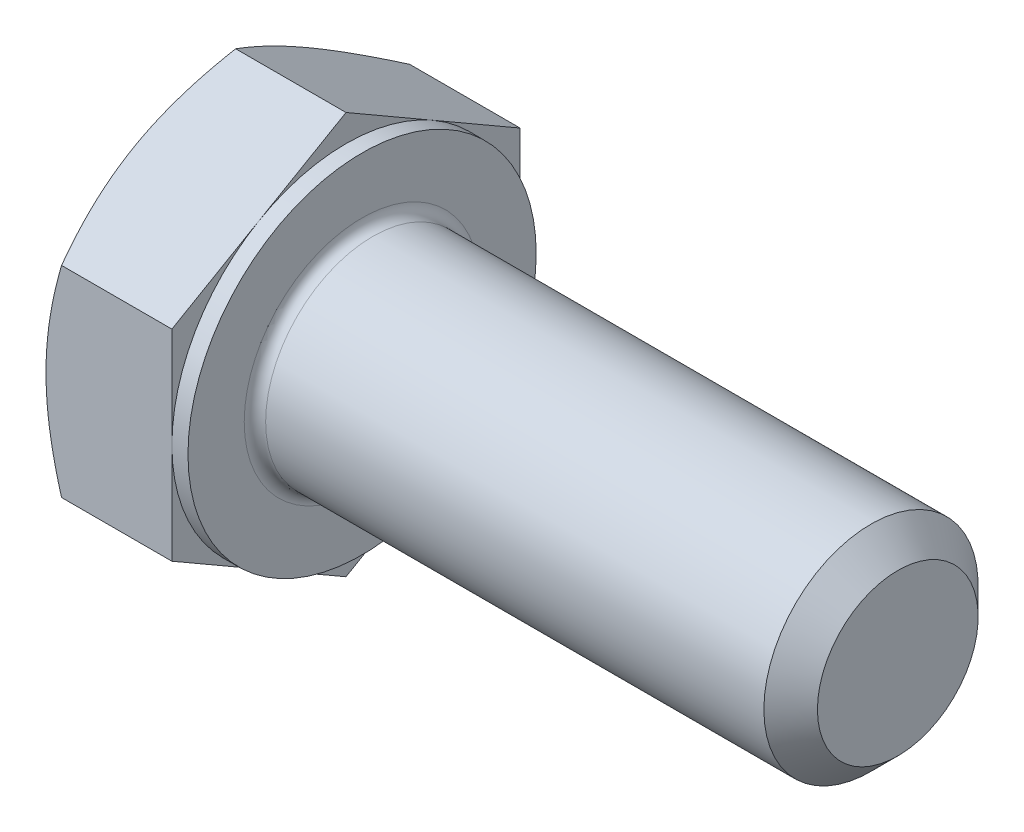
ISO-10303-21;
HEADER;
FILE_DESCRIPTION(('STEP AP214'),'2;1');
FILE_NAME('part.step','',(''),(''),'','','');
FILE_SCHEMA(('AUTOMOTIVE_DESIGN { 1 0 10303 214 1 1 1 1 }'));
ENDSEC;
DATA;
#1=APPLICATION_CONTEXT('core data for automotive mechanical design processes');
#2=APPLICATION_PROTOCOL_DEFINITION('international standard','automotive_design',2000,#1);
#3=PRODUCT_CONTEXT('',#1,'mechanical');
#4=PRODUCT('Part','Part','',(#3));
#5=PRODUCT_RELATED_PRODUCT_CATEGORY('part','',(#4));
#6=PRODUCT_DEFINITION_FORMATION('','',#4);
#7=PRODUCT_DEFINITION_CONTEXT('part definition',#1,'design');
#8=PRODUCT_DEFINITION('design','',#6,#7);
#9=PRODUCT_DEFINITION_SHAPE('','',#8);
#10=(LENGTH_UNIT() NAMED_UNIT(*) SI_UNIT(.MILLI.,.METRE.));
#11=(NAMED_UNIT(*) PLANE_ANGLE_UNIT() SI_UNIT($,.RADIAN.));
#12=(NAMED_UNIT(*) SI_UNIT($,.STERADIAN.) SOLID_ANGLE_UNIT());
#13=UNCERTAINTY_MEASURE_WITH_UNIT(LENGTH_MEASURE(1.E-05),#10,'distance_accuracy_value','');
#14=(GEOMETRIC_REPRESENTATION_CONTEXT(3) GLOBAL_UNCERTAINTY_ASSIGNED_CONTEXT((#13)) GLOBAL_UNIT_ASSIGNED_CONTEXT((#10,
#11,#12)) REPRESENTATION_CONTEXT('',''));
#15=CARTESIAN_POINT('',(0.,0.,0.));
#16=DIRECTION('',(0.,0.,1.));
#17=DIRECTION('',(1.,0.,0.));
#18=AXIS2_PLACEMENT_3D('',#15,#16,#17);
#19=CARTESIAN_POINT('',(5.3,3.75277674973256,-6.5));
#20=DIRECTION('',(0.,-0.866025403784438,0.500000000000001));
#21=DIRECTION('',(0.,-0.500000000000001,-0.866025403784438));
#22=AXIS2_PLACEMENT_3D('',#19,#20,#21);
#23=PLANE('',#22);
#24=DIRECTION('',(0.,0.500000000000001,0.866025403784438));
#25=VECTOR('',#24,1.);
#26=CARTESIAN_POINT('',(4.7,3.75277674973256,-6.5));
#27=LINE('',#26,#25);
#28=CARTESIAN_POINT('',(4.7,3.75277674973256,-6.5));
#29=VERTEX_POINT('',#28);
#30=CARTESIAN_POINT('',(4.7,5.62916512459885,-3.25000000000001));
#31=VERTEX_POINT('',#30);
#32=EDGE_CURVE('E175',#29,#31,#27,.T.);
#33=ORIENTED_EDGE('',*,*,#32,.F.);
#34=DIRECTION('',(-1.,0.,0.));
#35=VECTOR('',#34,1.);
#36=CARTESIAN_POINT('',(5.3,3.75277674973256,-6.5));
#37=LINE('',#36,#35);
#38=CARTESIAN_POINT('',(0.580556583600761,3.75277674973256,-6.5));
#39=VERTEX_POINT('',#38);
#40=EDGE_CURVE('E303',#29,#39,#37,.T.);
#41=ORIENTED_EDGE('',*,*,#40,.T.);
#42=CARTESIAN_POINT('',(0.580623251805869,7.50566896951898,0.000200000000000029));
#43=CARTESIAN_POINT('',(0.533004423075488,7.4231786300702,-0.14267745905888));
#44=CARTESIAN_POINT('',(0.487546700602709,7.34038072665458,-0.286087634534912));
#45=CARTESIAN_POINT('',(0.401548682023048,7.17411251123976,-0.574072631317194));
#46=CARTESIAN_POINT('',(0.361010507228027,7.09064192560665,-0.718647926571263));
#47=CARTESIAN_POINT('',(0.24757100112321,6.83889369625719,-1.15468865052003));
#48=CARTESIAN_POINT('',(0.183047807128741,6.66962231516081,-1.44787528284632));
#49=CARTESIAN_POINT('',(0.107386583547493,6.41631077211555,-1.88662374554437));
#50=CARTESIAN_POINT('',(0.0858328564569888,6.33302748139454,-2.03087463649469));
#51=CARTESIAN_POINT('',(0.04969031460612,6.16608458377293,-2.32002821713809));
#52=CARTESIAN_POINT('',(0.0351008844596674,6.08242501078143,-2.46493084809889));
#53=CARTESIAN_POINT('',(0.0132587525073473,5.91496056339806,-2.75498777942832));
#54=CARTESIAN_POINT('',(0.0059977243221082,5.8311559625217,-2.90014160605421));
#55=CARTESIAN_POINT('',(-0.00103969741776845,5.66347396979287,-3.19057533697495));
#56=CARTESIAN_POINT('',(-0.000816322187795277,5.5795965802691,-3.33585523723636));
#57=CARTESIAN_POINT('',(0.010083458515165,5.34979921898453,-3.73387594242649));
#58=CARTESIAN_POINT('',(0.0283818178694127,5.20395446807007,-3.98648646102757));
#59=CARTESIAN_POINT('',(0.0864063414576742,4.91323365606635,-4.49002967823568));
#60=CARTESIAN_POINT('',(0.126152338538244,4.76835861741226,-4.74096060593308));
#61=CARTESIAN_POINT('',(0.225505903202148,4.47705272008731,-5.24551722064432));
#62=CARTESIAN_POINT('',(0.285534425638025,4.33065861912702,-5.49907924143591));
#63=CARTESIAN_POINT('',(0.421774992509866,4.04005357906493,-6.00242193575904));
#64=CARTESIAN_POINT('',(0.49795503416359,3.89583891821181,-6.25220905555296));
#65=CARTESIAN_POINT('',(0.580623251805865,3.75266127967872,-6.5002));
#66=B_SPLINE_CURVE_WITH_KNOTS('',3,(#42,#43,#44,#45,#46,#47,#48,#49,#50,#51,#52,#53,#54,#55,#56,
#57,#58,#59,#60,#61,#62,#63,#64,#65),.UNSPECIFIED.,.F.,.F.,(4,2,2,2,2,2,2,2,2,2,2,4),(0.,
0.515105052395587,1.03043143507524,2.06322554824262,2.56697389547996,3.07067772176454,
3.57380860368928,4.0769239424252,4.9527935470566,5.82947446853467,6.72559912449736,
7.61996451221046),.UNSPECIFIED.);
#67=CARTESIAN_POINT('',(0.,5.62916512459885,-3.25000000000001));
#68=VERTEX_POINT('',#67);
#69=EDGE_CURVE('E230',#68,#39,#66,.T.);
#70=ORIENTED_EDGE('',*,*,#69,.F.);
#71=CARTESIAN_POINT('',(0.580556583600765,7.50555349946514,0.));
#72=VERTEX_POINT('',#71);
#73=EDGE_CURVE('E66',#72,#68,#66,.T.);
#74=ORIENTED_EDGE('',*,*,#73,.F.);
#75=DIRECTION('',(-1.,0.,0.));
#76=VECTOR('',#75,1.);
#77=CARTESIAN_POINT('',(5.3,7.50555349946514,0.));
#78=LINE('',#77,#76);
#79=CARTESIAN_POINT('',(4.7,7.50555349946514,0.));
#80=VERTEX_POINT('',#79);
#81=EDGE_CURVE('E295',#80,#72,#78,.T.);
#82=ORIENTED_EDGE('',*,*,#81,.F.);
#83=EDGE_CURVE('E173',#31,#80,#27,.T.);
#84=ORIENTED_EDGE('',*,*,#83,.F.);
#85=EDGE_LOOP('',(#33,#41,#70,#74,#82,#84));
#86=FACE_BOUND('',#85,.T.);
#87=ADVANCED_FACE('F43',(#86),#23,.F.);
#88=CARTESIAN_POINT('',(5.3,7.50555349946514,0.));
#89=DIRECTION('',(0.,-0.866025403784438,-0.500000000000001));
#90=DIRECTION('',(0.,0.500000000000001,-0.866025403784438));
#91=AXIS2_PLACEMENT_3D('',#88,#89,#90);
#92=PLANE('',#91);
#93=DIRECTION('',(0.,-0.500000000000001,0.866025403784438));
#94=VECTOR('',#93,1.);
#95=CARTESIAN_POINT('',(4.7,7.50555349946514,0.));
#96=LINE('',#95,#94);
#97=CARTESIAN_POINT('',(4.7,5.62916512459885,3.25000000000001));
#98=VERTEX_POINT('',#97);
#99=EDGE_CURVE('E172',#80,#98,#96,.T.);
#100=ORIENTED_EDGE('',*,*,#99,.F.);
#101=ORIENTED_EDGE('',*,*,#81,.T.);
#102=CARTESIAN_POINT('',(0.580623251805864,3.75266127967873,6.50019999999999));
#103=CARTESIAN_POINT('',(0.533004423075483,3.83515161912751,6.35732254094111));
#104=CARTESIAN_POINT('',(0.487546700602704,3.91794952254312,6.21391236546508));
#105=CARTESIAN_POINT('',(0.401548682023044,4.08421773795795,5.9259273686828));
#106=CARTESIAN_POINT('',(0.361010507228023,4.16768832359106,5.78135207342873));
#107=CARTESIAN_POINT('',(0.247571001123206,4.41943655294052,5.34531134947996));
#108=CARTESIAN_POINT('',(0.183047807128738,4.5887079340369,5.05212471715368));
#109=CARTESIAN_POINT('',(0.107386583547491,4.84201947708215,4.61337625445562));
#110=CARTESIAN_POINT('',(0.0858328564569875,4.92530276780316,4.4691253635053));
#111=CARTESIAN_POINT('',(0.0496903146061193,5.09224566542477,4.17997178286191));
#112=CARTESIAN_POINT('',(0.035100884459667,5.17590523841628,4.03506915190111));
#113=CARTESIAN_POINT('',(0.0132587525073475,5.34336968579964,3.74501222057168));
#114=CARTESIAN_POINT('',(0.00599772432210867,5.427174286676,3.59985839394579));
#115=CARTESIAN_POINT('',(-0.00103969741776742,5.59485627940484,3.30942466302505));
#116=CARTESIAN_POINT('',(-0.000816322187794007,5.67873366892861,3.16414476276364));
#117=CARTESIAN_POINT('',(0.0100834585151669,5.90853103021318,2.7661240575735));
#118=CARTESIAN_POINT('',(0.0283818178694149,6.05437578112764,2.51351353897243));
#119=CARTESIAN_POINT('',(0.0864063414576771,6.34509659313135,2.00997032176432));
#120=CARTESIAN_POINT('',(0.126152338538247,6.48997163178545,1.75903939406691));
#121=CARTESIAN_POINT('',(0.225505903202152,6.78127752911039,1.25448277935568));
#122=CARTESIAN_POINT('',(0.285534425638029,6.92767163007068,1.00092075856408));
#123=CARTESIAN_POINT('',(0.421774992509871,7.21827667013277,0.497578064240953));
#124=CARTESIAN_POINT('',(0.497955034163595,7.36249133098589,0.247790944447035));
#125=CARTESIAN_POINT('',(0.58062325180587,7.50566896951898,-0.000200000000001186));
#126=B_SPLINE_CURVE_WITH_KNOTS('',3,(#102,#103,#104,#105,#106,#107,#108,#109,#110,#111,#112,
#113,#114,#115,#116,#117,#118,#119,#120,#121,#122,#123,#124,#125),.UNSPECIFIED.,.F.,.F.,(4,2,2,
2,2,2,2,2,2,2,2,4),(0.,0.515105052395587,1.03043143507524,2.06322554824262,2.56697389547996,
3.07067772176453,3.57380860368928,4.0769239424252,4.9527935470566,5.82947446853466,
6.72559912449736,7.61996451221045),.UNSPECIFIED.);
#127=CARTESIAN_POINT('',(0.,5.62916512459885,3.25));
#128=VERTEX_POINT('',#127);
#129=EDGE_CURVE('E227',#128,#72,#126,.T.);
#130=ORIENTED_EDGE('',*,*,#129,.F.);
#131=CARTESIAN_POINT('',(0.58055658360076,3.75277674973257,6.49999999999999));
#132=VERTEX_POINT('',#131);
#133=EDGE_CURVE('E241',#132,#128,#126,.T.);
#134=ORIENTED_EDGE('',*,*,#133,.F.);
#135=DIRECTION('',(-1.,0.,0.));
#136=VECTOR('',#135,1.);
#137=CARTESIAN_POINT('',(5.3,3.75277674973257,6.49999999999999));
#138=LINE('',#137,#136);
#139=CARTESIAN_POINT('',(4.7,3.75277674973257,6.49999999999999));
#140=VERTEX_POINT('',#139);
#141=EDGE_CURVE('E297',#140,#132,#138,.T.);
#142=ORIENTED_EDGE('',*,*,#141,.F.);
#143=EDGE_CURVE('E140',#98,#140,#96,.T.);
#144=ORIENTED_EDGE('',*,*,#143,.F.);
#145=EDGE_LOOP('',(#100,#101,#130,#134,#142,#144));
#146=FACE_BOUND('',#145,.T.);
#147=ADVANCED_FACE('F248',(#146),#92,.F.);
#148=CARTESIAN_POINT('',(5.3,3.75277674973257,6.49999999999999));
#149=DIRECTION('',(0.,0.,-1.));
#150=DIRECTION('',(0.,1.,0.));
#151=AXIS2_PLACEMENT_3D('',#148,#149,#150);
#152=PLANE('',#151);
#153=DIRECTION('',(0.,-1.,0.));
#154=VECTOR('',#153,1.);
#155=CARTESIAN_POINT('',(4.7,3.75277674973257,6.49999999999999));
#156=LINE('',#155,#154);
#157=CARTESIAN_POINT('',(4.7,0.,6.5));
#158=VERTEX_POINT('',#157);
#159=EDGE_CURVE('E134',#140,#158,#156,.T.);
#160=ORIENTED_EDGE('',*,*,#159,.F.);
#161=ORIENTED_EDGE('',*,*,#141,.T.);
#162=CARTESIAN_POINT('',(3.18835311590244,-10.1137456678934,6.5));
#163=CARTESIAN_POINT('',(3.05034774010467,-9.82952666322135,6.5));
#164=CARTESIAN_POINT('',(2.91365616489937,-9.54465869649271,6.5));
#165=CARTESIAN_POINT('',(2.6436389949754,-8.97327978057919,6.5));
#166=CARTESIAN_POINT('',(2.51031392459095,-8.6867685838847,6.5));
#167=CARTESIAN_POINT('',(2.24710473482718,-8.11029837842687,6.5));
#168=CARTESIAN_POINT('',(2.11724300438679,-7.82032911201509,6.5));
#169=CARTESIAN_POINT('',(1.86279082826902,-7.23809541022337,6.5));
#170=CARTESIAN_POINT('',(1.73820013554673,-6.94583108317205,6.5));
#171=CARTESIAN_POINT('',(1.4917668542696,-6.34906440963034,6.5));
#172=CARTESIAN_POINT('',(1.37014257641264,-6.0444714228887,6.5));
#173=CARTESIAN_POINT('',(1.13601865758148,-5.43173420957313,6.5));
#174=CARTESIAN_POINT('',(1.02352003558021,-5.12358959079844,6.5));
#175=CARTESIAN_POINT('',(0.81057536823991,-4.50382569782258,6.5));
#176=CARTESIAN_POINT('',(0.710105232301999,-4.19221478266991,6.5));
#177=CARTESIAN_POINT('',(0.524420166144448,-3.5645201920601,6.5));
#178=CARTESIAN_POINT('',(0.439200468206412,-3.24843794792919,6.5));
#179=CARTESIAN_POINT('',(0.288524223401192,-2.61335465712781,6.5));
#180=CARTESIAN_POINT('',(0.222961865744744,-2.29437912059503,6.5));
#181=CARTESIAN_POINT('',(0.115312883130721,-1.65238219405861,6.5));
#182=CARTESIAN_POINT('',(0.07322390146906,-1.32936121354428,6.5));
#183=CARTESIAN_POINT('',(0.0304887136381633,-0.845231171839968,6.5));
#184=CARTESIAN_POINT('',(0.0196493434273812,-0.684982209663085,6.5));
#185=CARTESIAN_POINT('',(0.00475298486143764,-0.364162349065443,6.5));
#186=CARTESIAN_POINT('',(0.000695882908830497,-0.203591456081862,6.5));
#187=CARTESIAN_POINT('',(-0.000531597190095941,0.117577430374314,6.5));
#188=CARTESIAN_POINT('',(0.002298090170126,0.278175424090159,6.5));
#189=CARTESIAN_POINT('',(0.0147726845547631,0.599108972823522,6.5));
#190=CARTESIAN_POINT('',(0.0244179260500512,0.759444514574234,6.5));
#191=CARTESIAN_POINT('',(0.0554961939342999,1.14369946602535,6.5));
#192=CARTESIAN_POINT('',(0.080103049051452,1.36736763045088,6.49999999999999));
#193=CARTESIAN_POINT('',(0.141246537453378,1.81305591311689,6.49999999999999));
#194=CARTESIAN_POINT('',(0.177784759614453,2.0350758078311,6.49999999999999));
#195=CARTESIAN_POINT('',(0.303360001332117,2.69839633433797,6.49999999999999));
#196=CARTESIAN_POINT('',(0.408335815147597,3.13672010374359,6.49999999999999));
#197=CARTESIAN_POINT('',(0.590564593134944,3.7923211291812,6.49999999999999));
#198=CARTESIAN_POINT('',(0.656313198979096,4.01299150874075,6.49999999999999));
#199=CARTESIAN_POINT('',(0.794681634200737,4.45218859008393,6.49999999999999));
#200=CARTESIAN_POINT('',(0.867301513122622,4.67071527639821,6.49999999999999));
#201=CARTESIAN_POINT('',(1.01824353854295,5.10569490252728,6.49999999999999));
#202=CARTESIAN_POINT('',(1.09656388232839,5.32214847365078,6.49999999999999));
#203=CARTESIAN_POINT('',(1.25798086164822,5.75325725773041,6.49999999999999));
#204=CARTESIAN_POINT('',(1.34107741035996,5.96791250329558,6.49999999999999));
#205=CARTESIAN_POINT('',(1.56029019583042,6.51888445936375,6.49999999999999));
#206=CARTESIAN_POINT('',(1.69936356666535,6.85402316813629,6.49999999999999));
#207=CARTESIAN_POINT('',(1.98501958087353,7.52109583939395,6.49999999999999));
#208=CARTESIAN_POINT('',(2.13160288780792,7.85302951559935,6.49999999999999));
#209=CARTESIAN_POINT('',(2.43059748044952,8.51437865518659,6.49999999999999));
#210=CARTESIAN_POINT('',(2.5830105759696,8.84379329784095,6.49999999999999));
#211=CARTESIAN_POINT('',(2.89234869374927,9.50047798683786,6.49999999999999));
#212=CARTESIAN_POINT('',(3.04927357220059,9.82774810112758,6.49999999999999));
#213=CARTESIAN_POINT('',(3.36692013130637,10.4809971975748,6.49999999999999));
#214=CARTESIAN_POINT('',(3.52764676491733,10.8069737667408,6.49999999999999));
#215=CARTESIAN_POINT('',(3.851985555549,11.4574882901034,6.49999999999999));
#216=CARTESIAN_POINT('',(4.01559773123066,11.7820262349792,6.49999999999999));
#217=CARTESIAN_POINT('',(4.50986185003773,12.7537468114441,6.49999999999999));
#218=CARTESIAN_POINT('',(4.84399997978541,13.3991555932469,6.49999999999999));
#219=CARTESIAN_POINT('',(5.48575990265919,14.6239779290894,6.49999999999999));
#220=CARTESIAN_POINT('',(5.79279643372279,15.2036995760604,6.49999999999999));
#221=CARTESIAN_POINT('',(6.4106918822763,16.3611382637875,6.49999999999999));
#222=CARTESIAN_POINT('',(6.72155099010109,16.938855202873,6.49999999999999));
#223=CARTESIAN_POINT('',(7.34519775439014,18.0910273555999,6.49999999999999));
#224=CARTESIAN_POINT('',(7.65797694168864,18.665487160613,6.49999999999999));
#225=CARTESIAN_POINT('',(8.28574397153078,19.8131486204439,6.49999999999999));
#226=CARTESIAN_POINT('',(8.60073166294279,20.3863503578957,6.49999999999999));
#227=CARTESIAN_POINT('',(8.91652967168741,20.9591024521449,6.49999999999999));
#228=B_SPLINE_CURVE_WITH_KNOTS('',3,(#162,#163,#164,#165,#166,#167,#168,#169,#170,#171,#172,
#173,#174,#175,#176,#177,#178,#179,#180,#181,#182,#183,#184,#185,#186,#187,#188,#189,#190,#191,
#192,#193,#194,#195,#196,#197,#198,#199,#200,#201,#202,#203,#204,#205,#206,#207,#208,#209,#210,
#211,#212,#213,#214,#215,#216,#217,#218,#219,#220,#221,#222,#223,#224,#225,#226,#227),
.UNSPECIFIED.,.F.,.F.,(4,2,2,2,2,2,2,2,2,2,2,2,2,2,2,2,2,2,2,2,2,2,2,2,2,2,2,2,2,2,2,2,4),(0.,
0.947868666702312,1.89588406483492,2.84900320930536,3.80207763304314,4.7858977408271,
5.76982755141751,6.75175256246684,7.73337005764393,8.7096047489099,9.68574140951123,
10.1674651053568,10.6491807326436,11.1309009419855,11.6126447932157,12.287317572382,
12.9620802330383,14.3123184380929,15.0030310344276,15.6937486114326,16.384248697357,
17.0747362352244,18.1631508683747,19.2516618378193,20.3405135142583,21.4293305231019,
22.5196540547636,23.6099846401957,25.7902468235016,27.7582608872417,29.7263733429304,
31.6886408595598,33.6507753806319),.UNSPECIFIED.);
#229=CARTESIAN_POINT('',(0.,0.,6.5));
#230=VERTEX_POINT('',#229);
#231=EDGE_CURVE('E242',#230,#132,#228,.T.);
#232=ORIENTED_EDGE('',*,*,#231,.F.);
#233=CARTESIAN_POINT('',(0.580556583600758,-3.75277674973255,6.5));
#234=VERTEX_POINT('',#233);
#235=EDGE_CURVE('E304',#234,#230,#228,.T.);
#236=ORIENTED_EDGE('',*,*,#235,.F.);
#237=DIRECTION('',(-1.,0.,0.));
#238=VECTOR('',#237,1.);
#239=CARTESIAN_POINT('',(5.3,-3.75277674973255,6.5));
#240=LINE('',#239,#238);
#241=CARTESIAN_POINT('',(4.7,-3.75277674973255,6.5));
#242=VERTEX_POINT('',#241);
#243=EDGE_CURVE('E166',#242,#234,#240,.T.);
#244=ORIENTED_EDGE('',*,*,#243,.F.);
#245=EDGE_CURVE('E144',#158,#242,#156,.T.);
#246=ORIENTED_EDGE('',*,*,#245,.F.);
#247=EDGE_LOOP('',(#160,#161,#232,#236,#244,#246));
#248=FACE_BOUND('',#247,.T.);
#249=ADVANCED_FACE('F164',(#248),#152,.F.);
#250=CARTESIAN_POINT('',(5.3,-7.50555349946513,0.));
#251=DIRECTION('',(0.,0.866025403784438,-0.500000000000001));
#252=DIRECTION('',(0.,0.500000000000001,0.866025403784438));
#253=AXIS2_PLACEMENT_3D('',#250,#251,#252);
#254=PLANE('',#253);
#255=DIRECTION('',(0.,-0.500000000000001,-0.866025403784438));
#256=VECTOR('',#255,1.);
#257=CARTESIAN_POINT('',(4.7,-7.50555349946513,0.));
#258=LINE('',#257,#256);
#259=CARTESIAN_POINT('',(4.7,-5.62916512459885,3.25000000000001));
#260=VERTEX_POINT('',#259);
#261=EDGE_CURVE('E151',#242,#260,#258,.T.);
#262=ORIENTED_EDGE('',*,*,#261,.F.);
#263=ORIENTED_EDGE('',*,*,#243,.T.);
#264=CARTESIAN_POINT('',(0.580623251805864,-7.50566896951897,-0.000199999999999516));
#265=CARTESIAN_POINT('',(0.533004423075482,-7.42317863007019,0.142677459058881));
#266=CARTESIAN_POINT('',(0.487546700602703,-7.34038072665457,0.286087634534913));
#267=CARTESIAN_POINT('',(0.401548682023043,-7.17411251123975,0.574072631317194));
#268=CARTESIAN_POINT('',(0.361010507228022,-7.09064192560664,0.718647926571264));
#269=CARTESIAN_POINT('',(0.247571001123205,-6.83889369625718,1.15468865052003));
#270=CARTESIAN_POINT('',(0.183047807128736,-6.6696223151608,1.44787528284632));
#271=CARTESIAN_POINT('',(0.107386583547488,-6.41631077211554,1.88662374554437));
#272=CARTESIAN_POINT('',(0.0858328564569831,-6.33302748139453,2.03087463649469));
#273=CARTESIAN_POINT('',(0.0496903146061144,-6.16608458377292,2.32002821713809));
#274=CARTESIAN_POINT('',(0.0351008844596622,-6.08242501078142,2.46493084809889));
#275=CARTESIAN_POINT('',(0.0132587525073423,-5.91496056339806,2.75498777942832));
#276=CARTESIAN_POINT('',(0.0059977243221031,-5.83115596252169,2.90014160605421));
#277=CARTESIAN_POINT('',(-0.0010396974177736,-5.66347396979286,3.19057533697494));
#278=CARTESIAN_POINT('',(-0.000816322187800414,-5.57959658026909,3.33585523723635));
#279=CARTESIAN_POINT('',(0.0100834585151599,-5.34979921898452,3.73387594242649));
#280=CARTESIAN_POINT('',(0.0283818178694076,-5.20395446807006,3.98648646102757));
#281=CARTESIAN_POINT('',(0.0864063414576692,-4.91323365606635,4.49002967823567));
#282=CARTESIAN_POINT('',(0.126152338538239,-4.76835861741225,4.74096060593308));
#283=CARTESIAN_POINT('',(0.225505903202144,-4.4770527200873,5.24551722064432));
#284=CARTESIAN_POINT('',(0.285534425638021,-4.33065861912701,5.49907924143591));
#285=CARTESIAN_POINT('',(0.421774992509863,-4.04005357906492,6.00242193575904));
#286=CARTESIAN_POINT('',(0.497955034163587,-3.8958389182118,6.25220905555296));
#287=CARTESIAN_POINT('',(0.580623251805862,-3.75266127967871,6.5002));
#288=B_SPLINE_CURVE_WITH_KNOTS('',3,(#264,#265,#266,#267,#268,#269,#270,#271,#272,#273,#274,
#275,#276,#277,#278,#279,#280,#281,#282,#283,#284,#285,#286,#287),.UNSPECIFIED.,.F.,.F.,(4,2,2,
2,2,2,2,2,2,2,2,4),(0.,0.515105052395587,1.03043143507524,2.06322554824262,2.56697389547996,
3.07067772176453,3.57380860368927,4.0769239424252,4.9527935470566,5.82947446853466,
6.72559912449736,7.61996451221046),.UNSPECIFIED.);
#289=CARTESIAN_POINT('',(0.,-5.62916512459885,3.25000000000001));
#290=VERTEX_POINT('',#289);
#291=EDGE_CURVE('E229',#290,#234,#288,.T.);
#292=ORIENTED_EDGE('',*,*,#291,.F.);
#293=CARTESIAN_POINT('',(0.580556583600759,-7.50555349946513,0.));
#294=VERTEX_POINT('',#293);
#295=EDGE_CURVE('E221',#294,#290,#288,.T.);
#296=ORIENTED_EDGE('',*,*,#295,.F.);
#297=DIRECTION('',(-1.,0.,0.));
#298=VECTOR('',#297,1.);
#299=CARTESIAN_POINT('',(5.3,-7.50555349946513,0.));
#300=LINE('',#299,#298);
#301=CARTESIAN_POINT('',(4.7,-7.50555349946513,0.));
#302=VERTEX_POINT('',#301);
#303=EDGE_CURVE('E300',#302,#294,#300,.T.);
#304=ORIENTED_EDGE('',*,*,#303,.F.);
#305=EDGE_CURVE('E167',#260,#302,#258,.T.);
#306=ORIENTED_EDGE('',*,*,#305,.F.);
#307=EDGE_LOOP('',(#262,#263,#292,#296,#304,#306));
#308=FACE_BOUND('',#307,.T.);
#309=ADVANCED_FACE('F212',(#308),#254,.F.);
#310=CARTESIAN_POINT('',(5.3,-3.75277674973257,-6.5));
#311=DIRECTION('',(0.,0.866025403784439,0.499999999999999));
#312=DIRECTION('',(0.,-0.499999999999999,0.866025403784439));
#313=AXIS2_PLACEMENT_3D('',#310,#311,#312);
#314=PLANE('',#313);
#315=DIRECTION('',(0.,0.499999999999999,-0.866025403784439));
#316=VECTOR('',#315,1.);
#317=CARTESIAN_POINT('',(4.7,-3.75277674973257,-6.5));
#318=LINE('',#317,#316);
#319=CARTESIAN_POINT('',(4.7,-5.62916512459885,-3.25));
#320=VERTEX_POINT('',#319);
#321=EDGE_CURVE('E350',#302,#320,#318,.T.);
#322=ORIENTED_EDGE('',*,*,#321,.F.);
#323=ORIENTED_EDGE('',*,*,#303,.T.);
#324=CARTESIAN_POINT('',(0.580623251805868,-3.75266127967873,-6.5002));
#325=CARTESIAN_POINT('',(0.533004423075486,-3.8351516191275,-6.35732254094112));
#326=CARTESIAN_POINT('',(0.487546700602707,-3.91794952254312,-6.21391236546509));
#327=CARTESIAN_POINT('',(0.401548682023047,-4.08421773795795,-5.92592736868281));
#328=CARTESIAN_POINT('',(0.361010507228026,-4.16768832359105,-5.78135207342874));
#329=CARTESIAN_POINT('',(0.247571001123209,-4.41943655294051,-5.34531134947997));
#330=CARTESIAN_POINT('',(0.183047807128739,-4.5887079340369,-5.05212471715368));
#331=CARTESIAN_POINT('',(0.107386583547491,-4.84201947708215,-4.61337625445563));
#332=CARTESIAN_POINT('',(0.0858328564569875,-4.92530276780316,-4.46912536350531));
#333=CARTESIAN_POINT('',(0.0496903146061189,-5.09224566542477,-4.17997178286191));
#334=CARTESIAN_POINT('',(0.0351008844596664,-5.17590523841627,-4.03506915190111));
#335=CARTESIAN_POINT('',(0.0132587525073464,-5.34336968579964,-3.74501222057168));
#336=CARTESIAN_POINT('',(0.00599772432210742,-5.427174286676,-3.59985839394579));
#337=CARTESIAN_POINT('',(-0.00103969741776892,-5.59485627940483,-3.30942466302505));
#338=CARTESIAN_POINT('',(-0.000816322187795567,-5.6787336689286,-3.16414476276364));
#339=CARTESIAN_POINT('',(0.0100834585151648,-5.90853103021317,-2.7661240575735));
#340=CARTESIAN_POINT('',(0.0283818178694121,-6.05437578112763,-2.51351353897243));
#341=CARTESIAN_POINT('',(0.0864063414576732,-6.34509659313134,-2.00997032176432));
#342=CARTESIAN_POINT('',(0.126152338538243,-6.48997163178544,-1.75903939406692));
#343=CARTESIAN_POINT('',(0.225505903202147,-6.78127752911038,-1.25448277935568));
#344=CARTESIAN_POINT('',(0.285534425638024,-6.92767163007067,-1.00092075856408));
#345=CARTESIAN_POINT('',(0.421774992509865,-7.21827667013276,-0.497578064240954));
#346=CARTESIAN_POINT('',(0.49795503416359,-7.36249133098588,-0.247790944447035));
#347=CARTESIAN_POINT('',(0.580623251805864,-7.50566896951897,0.00020000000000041));
#348=B_SPLINE_CURVE_WITH_KNOTS('',3,(#324,#325,#326,#327,#328,#329,#330,#331,#332,#333,#334,
#335,#336,#337,#338,#339,#340,#341,#342,#343,#344,#345,#346,#347),.UNSPECIFIED.,.F.,.F.,(4,2,2,
2,2,2,2,2,2,2,2,4),(0.,0.515105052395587,1.03043143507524,2.06322554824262,2.56697389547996,
3.07067772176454,3.57380860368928,4.0769239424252,4.9527935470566,5.82947446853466,
6.72559912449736,7.61996451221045),.UNSPECIFIED.);
#349=CARTESIAN_POINT('',(0.,-5.62916512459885,-3.24999999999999));
#350=VERTEX_POINT('',#349);
#351=EDGE_CURVE('E228',#350,#294,#348,.T.);
#352=ORIENTED_EDGE('',*,*,#351,.F.);
#353=CARTESIAN_POINT('',(0.580556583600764,-3.75277674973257,-6.5));
#354=VERTEX_POINT('',#353);
#355=EDGE_CURVE('E189',#354,#350,#348,.T.);
#356=ORIENTED_EDGE('',*,*,#355,.F.);
#357=DIRECTION('',(-1.,0.,0.));
#358=VECTOR('',#357,1.);
#359=CARTESIAN_POINT('',(5.3,-3.75277674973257,-6.5));
#360=LINE('',#359,#358);
#361=CARTESIAN_POINT('',(4.7,-3.75277674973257,-6.5));
#362=VERTEX_POINT('',#361);
#363=EDGE_CURVE('E302',#362,#354,#360,.T.);
#364=ORIENTED_EDGE('',*,*,#363,.F.);
#365=EDGE_CURVE('E162',#320,#362,#318,.T.);
#366=ORIENTED_EDGE('',*,*,#365,.F.);
#367=EDGE_LOOP('',(#322,#323,#352,#356,#364,#366));
#368=FACE_BOUND('',#367,.T.);
#369=ADVANCED_FACE('F205',(#368),#314,.F.);
#370=CARTESIAN_POINT('',(5.3,3.75277674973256,-6.5));
#371=DIRECTION('',(0.,0.,1.));
#372=DIRECTION('',(0.,-1.,0.));
#373=AXIS2_PLACEMENT_3D('',#370,#371,#372);
#374=PLANE('',#373);
#375=DIRECTION('',(0.,1.,0.));
#376=VECTOR('',#375,1.);
#377=CARTESIAN_POINT('',(4.7,3.75277674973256,-6.5));
#378=LINE('',#377,#376);
#379=CARTESIAN_POINT('',(4.7,0.,-6.5));
#380=VERTEX_POINT('',#379);
#381=EDGE_CURVE('E274',#362,#380,#378,.T.);
#382=ORIENTED_EDGE('',*,*,#381,.F.);
#383=ORIENTED_EDGE('',*,*,#363,.T.);
#384=CARTESIAN_POINT('',(3.18835311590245,-10.1137456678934,-6.5));
#385=CARTESIAN_POINT('',(3.05034774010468,-9.82952666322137,-6.5));
#386=CARTESIAN_POINT('',(2.91365616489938,-9.54465869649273,-6.5));
#387=CARTESIAN_POINT('',(2.64363899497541,-8.97327978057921,-6.5));
#388=CARTESIAN_POINT('',(2.51031392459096,-8.68676858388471,-6.5));
#389=CARTESIAN_POINT('',(2.24710473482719,-8.11029837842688,-6.5));
#390=CARTESIAN_POINT('',(2.1172430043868,-7.82032911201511,-6.5));
#391=CARTESIAN_POINT('',(1.86279082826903,-7.23809541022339,-6.5));
#392=CARTESIAN_POINT('',(1.73820013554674,-6.94583108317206,-6.5));
#393=CARTESIAN_POINT('',(1.49176685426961,-6.34906440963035,-6.5));
#394=CARTESIAN_POINT('',(1.37014257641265,-6.04447142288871,-6.5));
#395=CARTESIAN_POINT('',(1.13601865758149,-5.43173420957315,-6.5));
#396=CARTESIAN_POINT('',(1.02352003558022,-5.12358959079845,-6.5));
#397=CARTESIAN_POINT('',(0.810575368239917,-4.50382569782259,-6.5));
#398=CARTESIAN_POINT('',(0.710105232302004,-4.19221478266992,-6.5));
#399=CARTESIAN_POINT('',(0.524420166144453,-3.56452019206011,-6.5));
#400=CARTESIAN_POINT('',(0.439200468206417,-3.2484379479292,-6.5));
#401=CARTESIAN_POINT('',(0.288524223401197,-2.61335465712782,-6.5));
#402=CARTESIAN_POINT('',(0.222961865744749,-2.29437912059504,-6.5));
#403=CARTESIAN_POINT('',(0.115312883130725,-1.65238219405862,-6.5));
#404=CARTESIAN_POINT('',(0.0732239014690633,-1.32936121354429,-6.5));
#405=CARTESIAN_POINT('',(0.0304887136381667,-0.845231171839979,-6.5));
#406=CARTESIAN_POINT('',(0.0196493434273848,-0.684982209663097,-6.5));
#407=CARTESIAN_POINT('',(0.00475298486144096,-0.364162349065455,-6.5));
#408=CARTESIAN_POINT('',(0.000695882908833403,-0.203591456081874,-6.5));
#409=CARTESIAN_POINT('',(-0.000531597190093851,0.117577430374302,-6.5));
#410=CARTESIAN_POINT('',(0.00229809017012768,0.278175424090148,-6.5));
#411=CARTESIAN_POINT('',(0.0147726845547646,0.599108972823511,-6.5));
#412=CARTESIAN_POINT('',(0.0244179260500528,0.759444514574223,-6.5));
#413=CARTESIAN_POINT('',(0.0554961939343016,1.14369946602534,-6.5));
#414=CARTESIAN_POINT('',(0.0801030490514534,1.36736763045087,-6.5));
#415=CARTESIAN_POINT('',(0.141246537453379,1.81305591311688,-6.5));
#416=CARTESIAN_POINT('',(0.177784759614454,2.03507580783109,-6.5));
#417=CARTESIAN_POINT('',(0.303360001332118,2.69839633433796,-6.5));
#418=CARTESIAN_POINT('',(0.408335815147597,3.13672010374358,-6.5));
#419=CARTESIAN_POINT('',(0.590564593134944,3.79232112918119,-6.5));
#420=CARTESIAN_POINT('',(0.656313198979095,4.01299150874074,-6.5));
#421=CARTESIAN_POINT('',(0.794681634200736,4.45218859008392,-6.5));
#422=CARTESIAN_POINT('',(0.867301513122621,4.6707152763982,-6.5));
#423=CARTESIAN_POINT('',(1.01824353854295,5.10569490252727,-6.5));
#424=CARTESIAN_POINT('',(1.09656388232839,5.32214847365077,-6.5));
#425=CARTESIAN_POINT('',(1.25798086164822,5.7532572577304,-6.5));
#426=CARTESIAN_POINT('',(1.34107741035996,5.96791250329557,-6.5));
#427=CARTESIAN_POINT('',(1.56029019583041,6.51888445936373,-6.5));
#428=CARTESIAN_POINT('',(1.69936356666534,6.85402316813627,-6.5));
#429=CARTESIAN_POINT('',(1.98501958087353,7.52109583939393,-6.5));
#430=CARTESIAN_POINT('',(2.13160288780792,7.85302951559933,-6.5));
#431=CARTESIAN_POINT('',(2.43059748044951,8.51437865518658,-6.5));
#432=CARTESIAN_POINT('',(2.58301057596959,8.84379329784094,-6.5));
#433=CARTESIAN_POINT('',(2.89234869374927,9.50047798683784,-6.5));
#434=CARTESIAN_POINT('',(3.04927357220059,9.82774810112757,-6.5));
#435=CARTESIAN_POINT('',(3.36692013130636,10.4809971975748,-6.5));
#436=CARTESIAN_POINT('',(3.52764676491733,10.8069737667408,-6.5));
#437=CARTESIAN_POINT('',(3.85198555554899,11.4574882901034,-6.5));
#438=CARTESIAN_POINT('',(4.01559773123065,11.7820262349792,-6.5));
#439=CARTESIAN_POINT('',(4.50986185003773,12.753746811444,-6.5));
#440=CARTESIAN_POINT('',(4.8439999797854,13.3991555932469,-6.5));
#441=CARTESIAN_POINT('',(5.48575990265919,14.6239779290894,-6.5));
#442=CARTESIAN_POINT('',(5.79279643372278,15.2036995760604,-6.5));
#443=CARTESIAN_POINT('',(6.4106918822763,16.3611382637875,-6.5));
#444=CARTESIAN_POINT('',(6.72155099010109,16.938855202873,-6.5));
#445=CARTESIAN_POINT('',(7.34519775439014,18.0910273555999,-6.5));
#446=CARTESIAN_POINT('',(7.65797694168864,18.665487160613,-6.5));
#447=CARTESIAN_POINT('',(8.28574397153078,19.8131486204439,-6.5));
#448=CARTESIAN_POINT('',(8.60073166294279,20.3863503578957,-6.5));
#449=CARTESIAN_POINT('',(8.91652967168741,20.9591024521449,-6.49999999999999));
#450=B_SPLINE_CURVE_WITH_KNOTS('',3,(#384,#385,#386,#387,#388,#389,#390,#391,#392,#393,#394,
#395,#396,#397,#398,#399,#400,#401,#402,#403,#404,#405,#406,#407,#408,#409,#410,#411,#412,#413,
#414,#415,#416,#417,#418,#419,#420,#421,#422,#423,#424,#425,#426,#427,#428,#429,#430,#431,#432,
#433,#434,#435,#436,#437,#438,#439,#440,#441,#442,#443,#444,#445,#446,#447,#448,#449),
.UNSPECIFIED.,.F.,.F.,(4,2,2,2,2,2,2,2,2,2,2,2,2,2,2,2,2,2,2,2,2,2,2,2,2,2,2,2,2,2,2,2,4),(0.,
0.947868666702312,1.89588406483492,2.84900320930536,3.80207763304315,4.7858977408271,
5.76982755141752,6.75175256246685,7.73337005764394,8.70960474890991,9.68574140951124,
10.1674651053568,10.6491807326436,11.1309009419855,11.6126447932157,12.287317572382,
12.9620802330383,14.312318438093,15.0030310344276,15.6937486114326,16.3842486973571,
17.0747362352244,18.1631508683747,19.2516618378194,20.3405135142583,21.4293305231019,
22.5196540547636,23.6099846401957,25.7902468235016,27.7582608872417,29.7263733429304,
31.6886408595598,33.6507753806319),.UNSPECIFIED.);
#451=CARTESIAN_POINT('',(0.,0.,-6.5));
#452=VERTEX_POINT('',#451);
#453=EDGE_CURVE('E179',#452,#354,#450,.F.);
#454=ORIENTED_EDGE('',*,*,#453,.F.);
#455=EDGE_CURVE('E188',#39,#452,#450,.F.);
#456=ORIENTED_EDGE('',*,*,#455,.F.);
#457=ORIENTED_EDGE('',*,*,#40,.F.);
#458=EDGE_CURVE('E278',#380,#29,#378,.T.);
#459=ORIENTED_EDGE('',*,*,#458,.F.);
#460=EDGE_LOOP('',(#382,#383,#454,#456,#457,#459));
#461=FACE_BOUND('',#460,.T.);
#462=ADVANCED_FACE('F200',(#461),#374,.F.);
#463=CARTESIAN_POINT('',(0.,0.,0.));
#464=DIRECTION('',(1.,0.,0.));
#465=DIRECTION('',(0.,0.,-1.));
#466=AXIS2_PLACEMENT_3D('',#463,#464,#465);
#467=CONICAL_SURFACE('',#466,6.5,1.0471975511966);
#468=ORIENTED_EDGE('',*,*,#355,.T.);
#469=CARTESIAN_POINT('',(0.,0.,0.));
#470=DIRECTION('',(1.,0.,0.));
#471=DIRECTION('',(0.,0.,-1.));
#472=AXIS2_PLACEMENT_3D('',#469,#470,#471);
#473=CIRCLE('',#472,6.5);
#474=EDGE_CURVE('E291',#350,#452,#473,.T.);
#475=ORIENTED_EDGE('',*,*,#474,.T.);
#476=ORIENTED_EDGE('',*,*,#453,.T.);
#477=EDGE_LOOP('',(#468,#475,#476));
#478=FACE_BOUND('',#477,.T.);
#479=ADVANCED_FACE('F204',(#478),#467,.T.);
#480=ORIENTED_EDGE('',*,*,#295,.T.);
#481=EDGE_CURVE('E294',#290,#350,#473,.T.);
#482=ORIENTED_EDGE('',*,*,#481,.T.);
#483=ORIENTED_EDGE('',*,*,#351,.T.);
#484=EDGE_LOOP('',(#480,#482,#483));
#485=FACE_BOUND('',#484,.T.);
#486=ADVANCED_FACE('F347',(#485),#467,.T.);
#487=ORIENTED_EDGE('',*,*,#235,.T.);
#488=EDGE_CURVE('E324',#230,#290,#473,.T.);
#489=ORIENTED_EDGE('',*,*,#488,.T.);
#490=ORIENTED_EDGE('',*,*,#291,.T.);
#491=EDGE_LOOP('',(#487,#489,#490));
#492=FACE_BOUND('',#491,.T.);
#493=ADVANCED_FACE('F196',(#492),#467,.T.);
#494=ORIENTED_EDGE('',*,*,#231,.T.);
#495=ORIENTED_EDGE('',*,*,#133,.T.);
#496=CARTESIAN_POINT('',(0.,0.,0.));
#497=DIRECTION('',(-1.,0.,0.));
#498=DIRECTION('',(0.,0.,1.));
#499=AXIS2_PLACEMENT_3D('',#496,#497,#498);
#500=CIRCLE('',#499,6.5);
#501=EDGE_CURVE('E176',#230,#128,#500,.T.);
#502=ORIENTED_EDGE('',*,*,#501,.F.);
#503=EDGE_LOOP('',(#494,#495,#502));
#504=FACE_BOUND('',#503,.T.);
#505=ADVANCED_FACE('F318',(#504),#467,.T.);
#506=ORIENTED_EDGE('',*,*,#129,.T.);
#507=ORIENTED_EDGE('',*,*,#73,.T.);
#508=EDGE_CURVE('E289',#68,#128,#473,.T.);
#509=ORIENTED_EDGE('',*,*,#508,.T.);
#510=EDGE_LOOP('',(#506,#507,#509));
#511=FACE_BOUND('',#510,.T.);
#512=ADVANCED_FACE('F322',(#511),#467,.T.);
#513=ORIENTED_EDGE('',*,*,#69,.T.);
#514=ORIENTED_EDGE('',*,*,#455,.T.);
#515=EDGE_CURVE('E288',#452,#68,#473,.T.);
#516=ORIENTED_EDGE('',*,*,#515,.T.);
#517=EDGE_LOOP('',(#513,#514,#516));
#518=FACE_BOUND('',#517,.T.);
#519=ADVANCED_FACE('F338',(#518),#467,.T.);
#520=CARTESIAN_POINT('',(0.,7.50555349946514,0.));
#521=DIRECTION('',(1.,0.,0.));
#522=DIRECTION('',(0.,0.,-1.));
#523=AXIS2_PLACEMENT_3D('',#520,#521,#522);
#524=PLANE('',#523);
#525=ORIENTED_EDGE('',*,*,#515,.F.);
#526=ORIENTED_EDGE('',*,*,#474,.F.);
#527=ORIENTED_EDGE('',*,*,#481,.F.);
#528=ORIENTED_EDGE('',*,*,#488,.F.);
#529=ORIENTED_EDGE('',*,*,#501,.T.);
#530=ORIENTED_EDGE('',*,*,#508,.F.);
#531=EDGE_LOOP('',(#525,#526,#527,#528,#529,#530));
#532=FACE_BOUND('',#531,.T.);
#533=ADVANCED_FACE('F207',(#532),#524,.F.);
#534=CARTESIAN_POINT('',(4.7,6.5,0.));
#535=DIRECTION('',(1.,0.,0.));
#536=DIRECTION('',(0.,0.,-1.));
#537=AXIS2_PLACEMENT_3D('',#534,#535,#536);
#538=PLANE('',#537);
#539=ORIENTED_EDGE('',*,*,#32,.T.);
#540=CARTESIAN_POINT('',(4.7,0.,0.));
#541=DIRECTION('',(-1.,0.,0.));
#542=DIRECTION('',(0.,0.,1.));
#543=AXIS2_PLACEMENT_3D('',#540,#541,#542);
#544=CIRCLE('',#543,6.5);
#545=EDGE_CURVE('E58',#31,#380,#544,.T.);
#546=ORIENTED_EDGE('',*,*,#545,.T.);
#547=ORIENTED_EDGE('',*,*,#458,.T.);
#548=EDGE_LOOP('',(#539,#546,#547));
#549=FACE_BOUND('',#548,.T.);
#550=ADVANCED_FACE('F356',(#549),#538,.T.);
#551=ORIENTED_EDGE('',*,*,#83,.T.);
#552=ORIENTED_EDGE('',*,*,#99,.T.);
#553=EDGE_CURVE('E161',#98,#31,#544,.T.);
#554=ORIENTED_EDGE('',*,*,#553,.T.);
#555=EDGE_LOOP('',(#551,#552,#554));
#556=FACE_BOUND('',#555,.T.);
#557=ADVANCED_FACE('F358',(#556),#538,.T.);
#558=ORIENTED_EDGE('',*,*,#143,.T.);
#559=ORIENTED_EDGE('',*,*,#159,.T.);
#560=EDGE_CURVE('E138',#158,#98,#544,.T.);
#561=ORIENTED_EDGE('',*,*,#560,.T.);
#562=EDGE_LOOP('',(#558,#559,#561));
#563=FACE_BOUND('',#562,.T.);
#564=ADVANCED_FACE('F136',(#563),#538,.T.);
#565=ORIENTED_EDGE('',*,*,#245,.T.);
#566=ORIENTED_EDGE('',*,*,#261,.T.);
#567=EDGE_CURVE('E148',#260,#158,#544,.T.);
#568=ORIENTED_EDGE('',*,*,#567,.T.);
#569=EDGE_LOOP('',(#565,#566,#568));
#570=FACE_BOUND('',#569,.T.);
#571=ADVANCED_FACE('F149',(#570),#538,.T.);
#572=ORIENTED_EDGE('',*,*,#305,.T.);
#573=ORIENTED_EDGE('',*,*,#321,.T.);
#574=EDGE_CURVE('E155',#320,#260,#544,.T.);
#575=ORIENTED_EDGE('',*,*,#574,.T.);
#576=EDGE_LOOP('',(#572,#573,#575));
#577=FACE_BOUND('',#576,.T.);
#578=ADVANCED_FACE('F372',(#577),#538,.T.);
#579=ORIENTED_EDGE('',*,*,#365,.T.);
#580=ORIENTED_EDGE('',*,*,#381,.T.);
#581=EDGE_CURVE('E355',#380,#320,#544,.T.);
#582=ORIENTED_EDGE('',*,*,#581,.T.);
#583=EDGE_LOOP('',(#579,#580,#582));
#584=FACE_BOUND('',#583,.T.);
#585=ADVANCED_FACE('F353',(#584),#538,.T.);
#586=CARTESIAN_POINT('',(0.,0.,0.));
#587=DIRECTION('',(-1.,0.,0.));
#588=DIRECTION('',(0.,0.,1.));
#589=AXIS2_PLACEMENT_3D('',#586,#587,#588);
#590=CYLINDRICAL_SURFACE('',#589,6.5);
#591=ORIENTED_EDGE('',*,*,#545,.F.);
#592=ORIENTED_EDGE('',*,*,#553,.F.);
#593=ORIENTED_EDGE('',*,*,#560,.F.);
#594=ORIENTED_EDGE('',*,*,#567,.F.);
#595=ORIENTED_EDGE('',*,*,#574,.F.);
#596=ORIENTED_EDGE('',*,*,#581,.F.);
#597=EDGE_LOOP('',(#591,#592,#593,#594,#595,#596));
#598=FACE_BOUND('',#597,.T.);
#599=CARTESIAN_POINT('',(5.3,0.,0.));
#600=DIRECTION('',(1.,0.,0.));
#601=DIRECTION('',(0.,0.,-1.));
#602=AXIS2_PLACEMENT_3D('',#599,#600,#601);
#603=CIRCLE('',#602,6.5);
#604=CARTESIAN_POINT('',(5.3,0.,-6.5));
#605=VERTEX_POINT('',#604);
#606=EDGE_CURVE('E287',#605,#605,#603,.T.);
#607=ORIENTED_EDGE('',*,*,#606,.F.);
#608=EDGE_LOOP('',(#607));
#609=FACE_BOUND('',#608,.T.);
#610=ADVANCED_FACE('F158',(#598,#609),#590,.T.);
#611=CARTESIAN_POINT('',(25.3,0.,0.));
#612=DIRECTION('',(-1.,0.,0.));
#613=DIRECTION('',(0.,0.,1.));
#614=AXIS2_PLACEMENT_3D('',#611,#612,#613);
#615=PLANE('',#614);
#616=CARTESIAN_POINT('',(25.3,0.,0.));
#617=DIRECTION('',(-1.,0.,0.));
#618=DIRECTION('',(0.,0.,1.));
#619=AXIS2_PLACEMENT_3D('',#616,#617,#618);
#620=CIRCLE('',#619,3.);
#621=CARTESIAN_POINT('',(25.3,0.,3.));
#622=VERTEX_POINT('',#621);
#623=EDGE_CURVE('E269',#622,#622,#620,.F.);
#624=ORIENTED_EDGE('',*,*,#623,.T.);
#625=EDGE_LOOP('',(#624));
#626=FACE_BOUND('',#625,.T.);
#627=ADVANCED_FACE('F366',(#626),#615,.F.);
#628=CARTESIAN_POINT('',(0.,0.,0.));
#629=DIRECTION('',(-1.,0.,0.));
#630=DIRECTION('',(0.,0.,1.));
#631=AXIS2_PLACEMENT_3D('',#628,#629,#630);
#632=CYLINDRICAL_SURFACE('',#631,4.);
#633=CARTESIAN_POINT('',(5.7,0.,0.));
#634=DIRECTION('',(1.,0.,0.));
#635=DIRECTION('',(0.,0.,-1.));
#636=AXIS2_PLACEMENT_3D('',#633,#634,#635);
#637=CIRCLE('',#636,4.);
#638=CARTESIAN_POINT('',(5.7,0.,-4.));
#639=VERTEX_POINT('',#638);
#640=EDGE_CURVE('E12',#639,#639,#637,.T.);
#641=ORIENTED_EDGE('',*,*,#640,.T.);
#642=EDGE_LOOP('',(#641));
#643=FACE_BOUND('',#642,.T.);
#644=CARTESIAN_POINT('',(24.3,0.,0.));
#645=DIRECTION('',(-1.,0.,0.));
#646=DIRECTION('',(0.,0.,1.));
#647=AXIS2_PLACEMENT_3D('',#644,#645,#646);
#648=CIRCLE('',#647,4.);
#649=CARTESIAN_POINT('',(24.3,0.,4.));
#650=VERTEX_POINT('',#649);
#651=EDGE_CURVE('E272',#650,#650,#648,.T.);
#652=ORIENTED_EDGE('',*,*,#651,.T.);
#653=EDGE_LOOP('',(#652));
#654=FACE_BOUND('',#653,.T.);
#655=ADVANCED_FACE('F264',(#643,#654),#632,.T.);
#656=CARTESIAN_POINT('',(5.3,7.50555349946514,0.));
#657=DIRECTION('',(1.,0.,0.));
#658=DIRECTION('',(0.,0.,-1.));
#659=AXIS2_PLACEMENT_3D('',#656,#657,#658);
#660=PLANE('',#659);
#661=CARTESIAN_POINT('',(5.3,0.,0.));
#662=DIRECTION('',(1.,0.,0.));
#663=DIRECTION('',(0.,0.,-1.));
#664=AXIS2_PLACEMENT_3D('',#661,#662,#663);
#665=CIRCLE('',#664,4.4);
#666=CARTESIAN_POINT('',(5.3,0.,-4.4));
#667=VERTEX_POINT('',#666);
#668=EDGE_CURVE('E51',#667,#667,#665,.F.);
#669=ORIENTED_EDGE('',*,*,#668,.T.);
#670=EDGE_LOOP('',(#669));
#671=FACE_BOUND('',#670,.T.);
#672=ORIENTED_EDGE('',*,*,#606,.T.);
#673=EDGE_LOOP('',(#672));
#674=FACE_BOUND('',#673,.T.);
#675=ADVANCED_FACE('F257',(#671,#674),#660,.T.);
#676=CARTESIAN_POINT('',(24.3,0.,0.));
#677=DIRECTION('',(-1.,0.,0.));
#678=DIRECTION('',(0.,0.,1.));
#679=AXIS2_PLACEMENT_3D('',#676,#677,#678);
#680=CONICAL_SURFACE('',#679,4.,0.78539816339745);
#681=ORIENTED_EDGE('',*,*,#623,.F.);
#682=EDGE_LOOP('',(#681));
#683=FACE_BOUND('',#682,.T.);
#684=ORIENTED_EDGE('',*,*,#651,.F.);
#685=EDGE_LOOP('',(#684));
#686=FACE_BOUND('',#685,.T.);
#687=ADVANCED_FACE('F255',(#683,#686),#680,.T.);
#688=CARTESIAN_POINT('',(5.7,0.,0.));
#689=DIRECTION('',(1.,0.,0.));
#690=DIRECTION('',(0.,0.,-1.));
#691=AXIS2_PLACEMENT_3D('',#688,#689,#690);
#692=TOROIDAL_SURFACE('',#691,4.4,0.4);
#693=ORIENTED_EDGE('',*,*,#640,.F.);
#694=EDGE_LOOP('',(#693));
#695=FACE_BOUND('',#694,.T.);
#696=ORIENTED_EDGE('',*,*,#668,.F.);
#697=EDGE_LOOP('',(#696));
#698=FACE_BOUND('',#697,.T.);
#699=ADVANCED_FACE('F45',(#695,#698),#692,.F.);
#700=CLOSED_SHELL('',(#87,#147,#249,#309,#369,#462,#479,#486,#493,#505,#512,#519,#533,#550,#557,
#564,#571,#578,#585,#610,#627,#655,#675,#687,#699));
#701=MANIFOLD_SOLID_BREP('B2',#700);
#702=ADVANCED_BREP_SHAPE_REPRESENTATION('',(#18,#701),#14);
#703=SHAPE_DEFINITION_REPRESENTATION(#9,#702);
ENDSEC;
END-ISO-10303-21;
